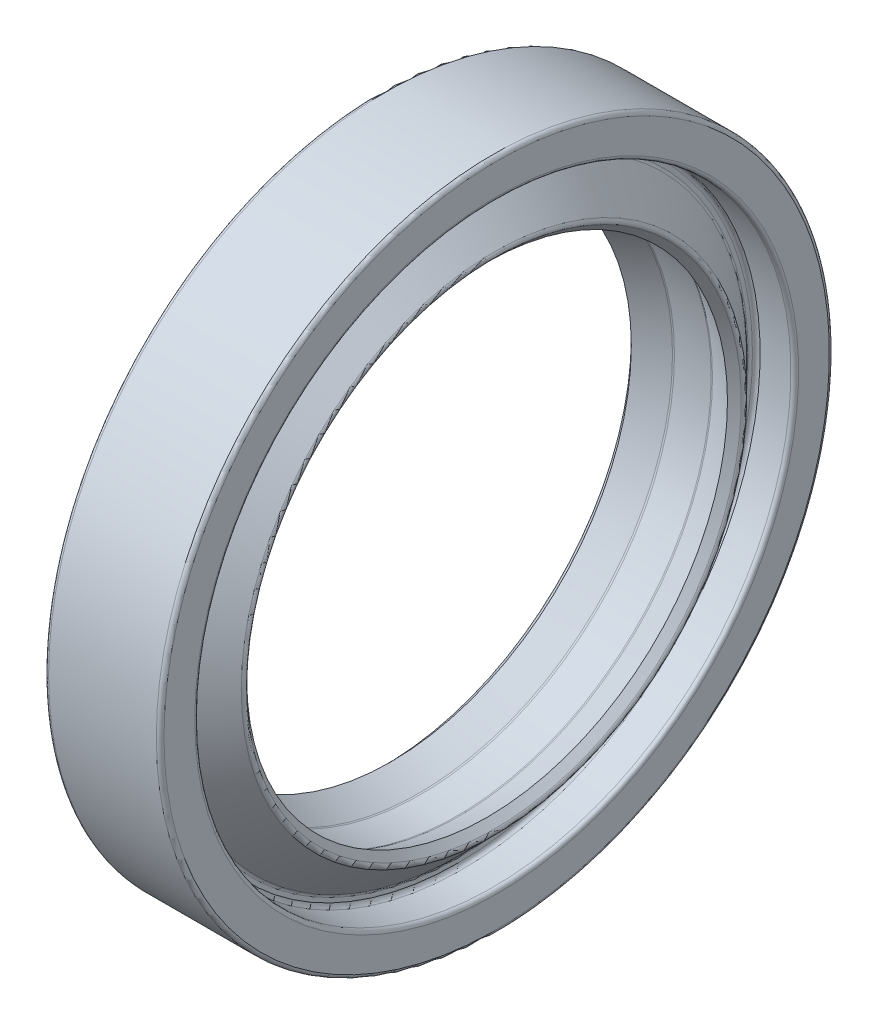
ISO-10303-21;
HEADER;
FILE_DESCRIPTION(('STEP AP214'),'2;1');
FILE_NAME('part.step','',(''),(''),'','','');
FILE_SCHEMA(('AUTOMOTIVE_DESIGN { 1 0 10303 214 1 1 1 1 }'));
ENDSEC;
DATA;
#1=APPLICATION_CONTEXT('core data for automotive mechanical design processes');
#2=APPLICATION_PROTOCOL_DEFINITION('international standard','automotive_design',2000,#1);
#3=PRODUCT_CONTEXT('',#1,'mechanical');
#4=PRODUCT('Part','Part','',(#3));
#5=PRODUCT_RELATED_PRODUCT_CATEGORY('part','',(#4));
#6=PRODUCT_DEFINITION_FORMATION('','',#4);
#7=PRODUCT_DEFINITION_CONTEXT('part definition',#1,'design');
#8=PRODUCT_DEFINITION('design','',#6,#7);
#9=PRODUCT_DEFINITION_SHAPE('','',#8);
#10=(LENGTH_UNIT() NAMED_UNIT(*) SI_UNIT(.MILLI.,.METRE.));
#11=(NAMED_UNIT(*) PLANE_ANGLE_UNIT() SI_UNIT($,.RADIAN.));
#12=(NAMED_UNIT(*) SI_UNIT($,.STERADIAN.) SOLID_ANGLE_UNIT());
#13=UNCERTAINTY_MEASURE_WITH_UNIT(LENGTH_MEASURE(1.E-05),#10,'distance_accuracy_value','');
#14=(GEOMETRIC_REPRESENTATION_CONTEXT(3) GLOBAL_UNCERTAINTY_ASSIGNED_CONTEXT((#13)) GLOBAL_UNIT_ASSIGNED_CONTEXT((#10,
#11,#12)) REPRESENTATION_CONTEXT('',''));
#15=CARTESIAN_POINT('',(0.,0.,0.));
#16=DIRECTION('',(0.,0.,1.));
#17=DIRECTION('',(1.,0.,0.));
#18=AXIS2_PLACEMENT_3D('',#15,#16,#17);
#19=CARTESIAN_POINT('',(0.,0.,0.));
#20=DIRECTION('',(-1.,0.,0.));
#21=DIRECTION('',(0.,0.,1.));
#22=AXIS2_PLACEMENT_3D('',#19,#20,#21);
#23=CONICAL_SURFACE('',#22,13.,0.785398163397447);
#24=CARTESIAN_POINT('',(0.141421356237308,0.,0.));
#25=DIRECTION('',(1.,0.,0.));
#26=DIRECTION('',(0.,0.,-1.));
#27=AXIS2_PLACEMENT_3D('',#24,#25,#26);
#28=CIRCLE('',#27,12.8585786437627);
#29=CARTESIAN_POINT('',(0.141421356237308,0.,-12.8585786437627));
#30=VERTEX_POINT('',#29);
#31=EDGE_CURVE('E44',#30,#30,#28,.F.);
#32=ORIENTED_EDGE('',*,*,#31,.T.);
#33=EDGE_LOOP('',(#32));
#34=FACE_BOUND('',#33,.T.);
#35=CARTESIAN_POINT('',(0.5,0.,0.));
#36=DIRECTION('',(-1.,0.,0.));
#37=DIRECTION('',(0.,0.,1.));
#38=AXIS2_PLACEMENT_3D('',#35,#36,#37);
#39=CIRCLE('',#38,12.5);
#40=CARTESIAN_POINT('',(0.5,0.,12.5));
#41=VERTEX_POINT('',#40);
#42=EDGE_CURVE('E104',#41,#41,#39,.T.);
#43=ORIENTED_EDGE('',*,*,#42,.F.);
#44=EDGE_LOOP('',(#43));
#45=FACE_BOUND('',#44,.T.);
#46=ADVANCED_FACE('F22',(#34,#45),#23,.F.);
#47=CARTESIAN_POINT('',(2.,0.,0.));
#48=DIRECTION('',(1.,0.,0.));
#49=DIRECTION('',(0.,0.,-1.));
#50=AXIS2_PLACEMENT_3D('',#47,#48,#49);
#51=CONICAL_SURFACE('',#50,15.,0.785398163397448);
#52=CARTESIAN_POINT('',(1.94142135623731,0.,0.));
#53=DIRECTION('',(1.,0.,0.));
#54=DIRECTION('',(0.,0.,-1.));
#55=AXIS2_PLACEMENT_3D('',#52,#53,#54);
#56=CIRCLE('',#55,14.9414213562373);
#57=CARTESIAN_POINT('',(1.94142135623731,0.,-14.9414213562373));
#58=VERTEX_POINT('',#57);
#59=EDGE_CURVE('E47',#58,#58,#56,.F.);
#60=ORIENTED_EDGE('',*,*,#59,.T.);
#61=EDGE_LOOP('',(#60));
#62=FACE_BOUND('',#61,.T.);
#63=CARTESIAN_POINT('',(0.141421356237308,0.,0.));
#64=DIRECTION('',(-1.,0.,0.));
#65=DIRECTION('',(0.,0.,1.));
#66=AXIS2_PLACEMENT_3D('',#63,#64,#65);
#67=CIRCLE('',#66,13.1414213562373);
#68=CARTESIAN_POINT('',(0.141421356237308,0.,13.1414213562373));
#69=VERTEX_POINT('',#68);
#70=EDGE_CURVE('E50',#69,#69,#67,.F.);
#71=ORIENTED_EDGE('',*,*,#70,.T.);
#72=EDGE_LOOP('',(#71));
#73=FACE_BOUND('',#72,.T.);
#74=ADVANCED_FACE('F111',(#62,#73),#51,.T.);
#75=CARTESIAN_POINT('',(2.,15.5,0.));
#76=DIRECTION('',(1.,0.,0.));
#77=DIRECTION('',(0.,0.,-1.));
#78=AXIS2_PLACEMENT_3D('',#75,#76,#77);
#79=PLANE('',#78);
#80=CARTESIAN_POINT('',(2.,0.,0.));
#81=DIRECTION('',(1.,0.,0.));
#82=DIRECTION('',(0.,0.,-1.));
#83=AXIS2_PLACEMENT_3D('',#80,#81,#82);
#84=CIRCLE('',#83,15.3);
#85=CARTESIAN_POINT('',(2.,0.,-15.3));
#86=VERTEX_POINT('',#85);
#87=EDGE_CURVE('E53',#86,#86,#84,.F.);
#88=ORIENTED_EDGE('',*,*,#87,.T.);
#89=EDGE_LOOP('',(#88));
#90=FACE_BOUND('',#89,.T.);
#91=CARTESIAN_POINT('',(2.,0.,0.));
#92=DIRECTION('',(1.,0.,0.));
#93=DIRECTION('',(0.,0.,-1.));
#94=AXIS2_PLACEMENT_3D('',#91,#92,#93);
#95=CIRCLE('',#94,15.0828427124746);
#96=CARTESIAN_POINT('',(2.,0.,-15.0828427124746));
#97=VERTEX_POINT('',#96);
#98=EDGE_CURVE('E56',#97,#97,#95,.T.);
#99=ORIENTED_EDGE('',*,*,#98,.T.);
#100=EDGE_LOOP('',(#99));
#101=FACE_BOUND('',#100,.T.);
#102=ADVANCED_FACE('F116',(#90,#101),#79,.F.);
#103=CARTESIAN_POINT('',(-58.0974245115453,0.,0.));
#104=DIRECTION('',(-1.,0.,0.));
#105=DIRECTION('',(0.,0.,1.));
#106=AXIS2_PLACEMENT_3D('',#103,#104,#105);
#107=CYLINDRICAL_SURFACE('',#106,15.5);
#108=CARTESIAN_POINT('',(0.199999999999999,0.,0.));
#109=DIRECTION('',(1.,0.,0.));
#110=DIRECTION('',(0.,0.,-1.));
#111=AXIS2_PLACEMENT_3D('',#108,#109,#110);
#112=CIRCLE('',#111,15.5);
#113=CARTESIAN_POINT('',(0.199999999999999,0.,-15.5));
#114=VERTEX_POINT('',#113);
#115=EDGE_CURVE('E65',#114,#114,#112,.F.);
#116=ORIENTED_EDGE('',*,*,#115,.T.);
#117=EDGE_LOOP('',(#116));
#118=FACE_BOUND('',#117,.T.);
#119=CARTESIAN_POINT('',(1.8,0.,0.));
#120=DIRECTION('',(1.,0.,0.));
#121=DIRECTION('',(0.,0.,-1.));
#122=AXIS2_PLACEMENT_3D('',#119,#120,#121);
#123=CIRCLE('',#122,15.5);
#124=CARTESIAN_POINT('',(1.8,0.,-15.5));
#125=VERTEX_POINT('',#124);
#126=EDGE_CURVE('E68',#125,#125,#123,.T.);
#127=ORIENTED_EDGE('',*,*,#126,.T.);
#128=EDGE_LOOP('',(#127));
#129=FACE_BOUND('',#128,.T.);
#130=ADVANCED_FACE('F199',(#118,#129),#107,.F.);
#131=CARTESIAN_POINT('',(0.,17.5,0.));
#132=DIRECTION('',(1.,0.,0.));
#133=DIRECTION('',(0.,0.,-1.));
#134=AXIS2_PLACEMENT_3D('',#131,#132,#133);
#135=PLANE('',#134);
#136=CARTESIAN_POINT('',(0.,0.,0.));
#137=DIRECTION('',(1.,0.,0.));
#138=DIRECTION('',(0.,0.,-1.));
#139=AXIS2_PLACEMENT_3D('',#136,#137,#138);
#140=CIRCLE('',#139,15.7);
#141=CARTESIAN_POINT('',(0.,0.,-15.7));
#142=VERTEX_POINT('',#141);
#143=EDGE_CURVE('E59',#142,#142,#140,.T.);
#144=ORIENTED_EDGE('',*,*,#143,.T.);
#145=EDGE_LOOP('',(#144));
#146=FACE_BOUND('',#145,.T.);
#147=CARTESIAN_POINT('',(0.,0.,0.));
#148=DIRECTION('',(1.,0.,0.));
#149=DIRECTION('',(0.,0.,-1.));
#150=AXIS2_PLACEMENT_3D('',#147,#148,#149);
#151=CIRCLE('',#150,17.3);
#152=CARTESIAN_POINT('',(0.,0.,-17.3));
#153=VERTEX_POINT('',#152);
#154=EDGE_CURVE('E62',#153,#153,#151,.F.);
#155=ORIENTED_EDGE('',*,*,#154,.T.);
#156=EDGE_LOOP('',(#155));
#157=FACE_BOUND('',#156,.T.);
#158=ADVANCED_FACE('F196',(#146,#157),#135,.F.);
#159=CARTESIAN_POINT('',(-58.0974245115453,0.,0.));
#160=DIRECTION('',(-1.,0.,0.));
#161=DIRECTION('',(0.,0.,1.));
#162=AXIS2_PLACEMENT_3D('',#159,#160,#161);
#163=CYLINDRICAL_SURFACE('',#162,17.5);
#164=CARTESIAN_POINT('',(5.8,0.,0.));
#165=DIRECTION('',(-1.,0.,0.));
#166=DIRECTION('',(0.,0.,1.));
#167=AXIS2_PLACEMENT_3D('',#164,#165,#166);
#168=CIRCLE('',#167,17.5);
#169=CARTESIAN_POINT('',(5.8,0.,17.5));
#170=VERTEX_POINT('',#169);
#171=EDGE_CURVE('E10',#170,#170,#168,.T.);
#172=ORIENTED_EDGE('',*,*,#171,.T.);
#173=EDGE_LOOP('',(#172));
#174=FACE_BOUND('',#173,.T.);
#175=CARTESIAN_POINT('',(0.199999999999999,0.,0.));
#176=DIRECTION('',(1.,0.,0.));
#177=DIRECTION('',(0.,0.,-1.));
#178=AXIS2_PLACEMENT_3D('',#175,#176,#177);
#179=CIRCLE('',#178,17.5);
#180=CARTESIAN_POINT('',(0.199999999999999,0.,-17.5));
#181=VERTEX_POINT('',#180);
#182=EDGE_CURVE('E28',#181,#181,#179,.T.);
#183=ORIENTED_EDGE('',*,*,#182,.T.);
#184=EDGE_LOOP('',(#183));
#185=FACE_BOUND('',#184,.T.);
#186=ADVANCED_FACE('F192',(#174,#185),#163,.T.);
#187=CARTESIAN_POINT('',(6.,15.5,0.));
#188=DIRECTION('',(-1.,0.,0.));
#189=DIRECTION('',(0.,0.,1.));
#190=AXIS2_PLACEMENT_3D('',#187,#188,#189);
#191=PLANE('',#190);
#192=CARTESIAN_POINT('',(6.,0.,0.));
#193=DIRECTION('',(-1.,0.,0.));
#194=DIRECTION('',(0.,0.,1.));
#195=AXIS2_PLACEMENT_3D('',#192,#193,#194);
#196=CIRCLE('',#195,15.7);
#197=CARTESIAN_POINT('',(6.,0.,15.7));
#198=VERTEX_POINT('',#197);
#199=EDGE_CURVE('E71',#198,#198,#196,.T.);
#200=ORIENTED_EDGE('',*,*,#199,.T.);
#201=EDGE_LOOP('',(#200));
#202=FACE_BOUND('',#201,.T.);
#203=CARTESIAN_POINT('',(6.,0.,0.));
#204=DIRECTION('',(-1.,0.,0.));
#205=DIRECTION('',(0.,0.,1.));
#206=AXIS2_PLACEMENT_3D('',#203,#204,#205);
#207=CIRCLE('',#206,17.3);
#208=CARTESIAN_POINT('',(6.,0.,17.3));
#209=VERTEX_POINT('',#208);
#210=EDGE_CURVE('E74',#209,#209,#207,.F.);
#211=ORIENTED_EDGE('',*,*,#210,.T.);
#212=EDGE_LOOP('',(#211));
#213=FACE_BOUND('',#212,.T.);
#214=ADVANCED_FACE('F188',(#202,#213),#191,.F.);
#215=CARTESIAN_POINT('',(-58.0974245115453,0.,0.));
#216=DIRECTION('',(-1.,0.,0.));
#217=DIRECTION('',(0.,0.,1.));
#218=AXIS2_PLACEMENT_3D('',#215,#216,#217);
#219=CYLINDRICAL_SURFACE('',#218,15.5);
#220=CARTESIAN_POINT('',(4.2,0.,0.));
#221=DIRECTION('',(-1.,0.,0.));
#222=DIRECTION('',(0.,0.,1.));
#223=AXIS2_PLACEMENT_3D('',#220,#221,#222);
#224=CIRCLE('',#223,15.5);
#225=CARTESIAN_POINT('',(4.2,0.,15.5));
#226=VERTEX_POINT('',#225);
#227=EDGE_CURVE('E83',#226,#226,#224,.T.);
#228=ORIENTED_EDGE('',*,*,#227,.T.);
#229=EDGE_LOOP('',(#228));
#230=FACE_BOUND('',#229,.T.);
#231=CARTESIAN_POINT('',(5.8,0.,0.));
#232=DIRECTION('',(-1.,0.,0.));
#233=DIRECTION('',(0.,0.,1.));
#234=AXIS2_PLACEMENT_3D('',#231,#232,#233);
#235=CIRCLE('',#234,15.5);
#236=CARTESIAN_POINT('',(5.8,0.,15.5));
#237=VERTEX_POINT('',#236);
#238=EDGE_CURVE('E86',#237,#237,#235,.F.);
#239=ORIENTED_EDGE('',*,*,#238,.T.);
#240=EDGE_LOOP('',(#239));
#241=FACE_BOUND('',#240,.T.);
#242=ADVANCED_FACE('F184',(#230,#241),#219,.F.);
#243=CARTESIAN_POINT('',(4.,15.,0.));
#244=DIRECTION('',(-1.,0.,0.));
#245=DIRECTION('',(0.,0.,1.));
#246=AXIS2_PLACEMENT_3D('',#243,#244,#245);
#247=PLANE('',#246);
#248=CARTESIAN_POINT('',(4.,0.,0.));
#249=DIRECTION('',(-1.,0.,0.));
#250=DIRECTION('',(0.,0.,1.));
#251=AXIS2_PLACEMENT_3D('',#248,#249,#250);
#252=CIRCLE('',#251,15.3);
#253=CARTESIAN_POINT('',(4.,0.,15.3));
#254=VERTEX_POINT('',#253);
#255=EDGE_CURVE('E77',#254,#254,#252,.F.);
#256=ORIENTED_EDGE('',*,*,#255,.T.);
#257=EDGE_LOOP('',(#256));
#258=FACE_BOUND('',#257,.T.);
#259=CARTESIAN_POINT('',(4.,0.,0.));
#260=DIRECTION('',(-1.,0.,0.));
#261=DIRECTION('',(0.,0.,1.));
#262=AXIS2_PLACEMENT_3D('',#259,#260,#261);
#263=CIRCLE('',#262,15.0828427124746);
#264=CARTESIAN_POINT('',(4.,0.,15.0828427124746));
#265=VERTEX_POINT('',#264);
#266=EDGE_CURVE('E80',#265,#265,#263,.T.);
#267=ORIENTED_EDGE('',*,*,#266,.T.);
#268=EDGE_LOOP('',(#267));
#269=FACE_BOUND('',#268,.T.);
#270=ADVANCED_FACE('F180',(#258,#269),#247,.F.);
#271=CARTESIAN_POINT('',(6.00000000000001,0.,0.));
#272=DIRECTION('',(-1.,0.,0.));
#273=DIRECTION('',(0.,0.,1.));
#274=AXIS2_PLACEMENT_3D('',#271,#272,#273);
#275=CONICAL_SURFACE('',#274,13.,0.785398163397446);
#276=CARTESIAN_POINT('',(5.85857864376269,0.,0.));
#277=DIRECTION('',(1.,0.,0.));
#278=DIRECTION('',(0.,0.,-1.));
#279=AXIS2_PLACEMENT_3D('',#276,#277,#278);
#280=CIRCLE('',#279,13.1414213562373);
#281=CARTESIAN_POINT('',(5.85857864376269,0.,-13.1414213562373));
#282=VERTEX_POINT('',#281);
#283=EDGE_CURVE('E36',#282,#282,#280,.F.);
#284=ORIENTED_EDGE('',*,*,#283,.T.);
#285=EDGE_LOOP('',(#284));
#286=FACE_BOUND('',#285,.T.);
#287=CARTESIAN_POINT('',(4.05857864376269,0.,0.));
#288=DIRECTION('',(-1.,0.,0.));
#289=DIRECTION('',(0.,0.,1.));
#290=AXIS2_PLACEMENT_3D('',#287,#288,#289);
#291=CIRCLE('',#290,14.9414213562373);
#292=CARTESIAN_POINT('',(4.05857864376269,0.,14.9414213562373));
#293=VERTEX_POINT('',#292);
#294=EDGE_CURVE('E41',#293,#293,#291,.F.);
#295=ORIENTED_EDGE('',*,*,#294,.T.);
#296=EDGE_LOOP('',(#295));
#297=FACE_BOUND('',#296,.T.);
#298=ADVANCED_FACE('F176',(#286,#297),#275,.T.);
#299=CARTESIAN_POINT('',(5.50000000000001,0.,0.));
#300=DIRECTION('',(1.,0.,0.));
#301=DIRECTION('',(0.,0.,-1.));
#302=AXIS2_PLACEMENT_3D('',#299,#300,#301);
#303=CONICAL_SURFACE('',#302,12.5,0.785398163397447);
#304=CARTESIAN_POINT('',(5.8585786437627,0.,0.));
#305=DIRECTION('',(-1.,0.,0.));
#306=DIRECTION('',(0.,0.,1.));
#307=AXIS2_PLACEMENT_3D('',#304,#305,#306);
#308=CIRCLE('',#307,12.8585786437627);
#309=CARTESIAN_POINT('',(5.8585786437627,0.,12.8585786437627));
#310=VERTEX_POINT('',#309);
#311=EDGE_CURVE('E32',#310,#310,#308,.F.);
#312=ORIENTED_EDGE('',*,*,#311,.T.);
#313=EDGE_LOOP('',(#312));
#314=FACE_BOUND('',#313,.T.);
#315=CARTESIAN_POINT('',(5.50000000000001,0.,0.));
#316=DIRECTION('',(-1.,0.,0.));
#317=DIRECTION('',(0.,0.,1.));
#318=AXIS2_PLACEMENT_3D('',#315,#316,#317);
#319=CIRCLE('',#318,12.5);
#320=CARTESIAN_POINT('',(5.50000000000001,0.,12.5));
#321=VERTEX_POINT('',#320);
#322=EDGE_CURVE('E101',#321,#321,#319,.T.);
#323=ORIENTED_EDGE('',*,*,#322,.T.);
#324=EDGE_LOOP('',(#323));
#325=FACE_BOUND('',#324,.T.);
#326=ADVANCED_FACE('F172',(#314,#325),#303,.F.);
#327=CARTESIAN_POINT('',(4.,0.,0.));
#328=DIRECTION('',(-1.,0.,0.));
#329=DIRECTION('',(0.,0.,1.));
#330=AXIS2_PLACEMENT_3D('',#327,#328,#329);
#331=CONICAL_SURFACE('',#330,13.2,0.436627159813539);
#332=CARTESIAN_POINT('',(4.04020722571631,0.,0.));
#333=DIRECTION('',(-1.,0.,0.));
#334=DIRECTION('',(0.,0.,1.));
#335=AXIS2_PLACEMENT_3D('',#332,#333,#334);
#336=CIRCLE('',#335,13.1812366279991);
#337=CARTESIAN_POINT('',(4.04020722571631,0.,13.1812366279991));
#338=VERTEX_POINT('',#337);
#339=EDGE_CURVE('E89',#338,#338,#336,.T.);
#340=ORIENTED_EDGE('',*,*,#339,.T.);
#341=EDGE_LOOP('',(#340));
#342=FACE_BOUND('',#341,.T.);
#343=ORIENTED_EDGE('',*,*,#322,.F.);
#344=EDGE_LOOP('',(#343));
#345=FACE_BOUND('',#344,.T.);
#346=ADVANCED_FACE('F168',(#342,#345),#331,.F.);
#347=CARTESIAN_POINT('',(-58.0974245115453,0.,0.));
#348=DIRECTION('',(-1.,0.,0.));
#349=DIRECTION('',(0.,0.,1.));
#350=AXIS2_PLACEMENT_3D('',#347,#348,#349);
#351=CYLINDRICAL_SURFACE('',#350,13.2);
#352=CARTESIAN_POINT('',(2.04436986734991,0.,0.));
#353=DIRECTION('',(-1.,0.,0.));
#354=DIRECTION('',(0.,0.,1.));
#355=AXIS2_PLACEMENT_3D('',#352,#353,#354);
#356=CIRCLE('',#355,13.2);
#357=CARTESIAN_POINT('',(2.04436986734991,0.,13.2));
#358=VERTEX_POINT('',#357);
#359=EDGE_CURVE('E95',#358,#358,#356,.T.);
#360=ORIENTED_EDGE('',*,*,#359,.T.);
#361=EDGE_LOOP('',(#360));
#362=FACE_BOUND('',#361,.T.);
#363=CARTESIAN_POINT('',(3.95563013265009,0.,0.));
#364=DIRECTION('',(-1.,0.,0.));
#365=DIRECTION('',(0.,0.,1.));
#366=AXIS2_PLACEMENT_3D('',#363,#364,#365);
#367=CIRCLE('',#366,13.2);
#368=CARTESIAN_POINT('',(3.95563013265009,0.,13.2));
#369=VERTEX_POINT('',#368);
#370=EDGE_CURVE('E98',#369,#369,#367,.F.);
#371=ORIENTED_EDGE('',*,*,#370,.T.);
#372=EDGE_LOOP('',(#371));
#373=FACE_BOUND('',#372,.T.);
#374=ADVANCED_FACE('F164',(#362,#373),#351,.F.);
#375=CARTESIAN_POINT('',(0.5,0.,0.));
#376=DIRECTION('',(1.,0.,0.));
#377=DIRECTION('',(0.,0.,-1.));
#378=AXIS2_PLACEMENT_3D('',#375,#376,#377);
#379=CONICAL_SURFACE('',#378,12.5,0.43662715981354);
#380=CARTESIAN_POINT('',(1.95979277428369,0.,0.));
#381=DIRECTION('',(1.,0.,0.));
#382=DIRECTION('',(0.,0.,-1.));
#383=AXIS2_PLACEMENT_3D('',#380,#381,#382);
#384=CIRCLE('',#383,13.1812366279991);
#385=CARTESIAN_POINT('',(1.95979277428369,0.,-13.1812366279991));
#386=VERTEX_POINT('',#385);
#387=EDGE_CURVE('E92',#386,#386,#384,.T.);
#388=ORIENTED_EDGE('',*,*,#387,.T.);
#389=EDGE_LOOP('',(#388));
#390=FACE_BOUND('',#389,.T.);
#391=ORIENTED_EDGE('',*,*,#42,.T.);
#392=EDGE_LOOP('',(#391));
#393=FACE_BOUND('',#392,.T.);
#394=ADVANCED_FACE('F108',(#390,#393),#379,.F.);
#395=CARTESIAN_POINT('',(2.04436986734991,0.,0.));
#396=DIRECTION('',(-1.,0.,0.));
#397=DIRECTION('',(0.,0.,1.));
#398=AXIS2_PLACEMENT_3D('',#395,#396,#397);
#399=TOROIDAL_SURFACE('',#398,13.,0.2);
#400=ORIENTED_EDGE('',*,*,#387,.F.);
#401=EDGE_LOOP('',(#400));
#402=FACE_BOUND('',#401,.T.);
#403=ORIENTED_EDGE('',*,*,#359,.F.);
#404=EDGE_LOOP('',(#403));
#405=FACE_BOUND('',#404,.T.);
#406=ADVANCED_FACE('F157',(#402,#405),#399,.F.);
#407=CARTESIAN_POINT('',(3.95563013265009,0.,0.));
#408=DIRECTION('',(-1.,0.,0.));
#409=DIRECTION('',(0.,0.,1.));
#410=AXIS2_PLACEMENT_3D('',#407,#408,#409);
#411=TOROIDAL_SURFACE('',#410,13.,0.2);
#412=ORIENTED_EDGE('',*,*,#370,.F.);
#413=EDGE_LOOP('',(#412));
#414=FACE_BOUND('',#413,.T.);
#415=ORIENTED_EDGE('',*,*,#339,.F.);
#416=EDGE_LOOP('',(#415));
#417=FACE_BOUND('',#416,.T.);
#418=ADVANCED_FACE('F153',(#414,#417),#411,.F.);
#419=CARTESIAN_POINT('',(4.2,0.,0.));
#420=DIRECTION('',(-1.,0.,0.));
#421=DIRECTION('',(0.,0.,1.));
#422=AXIS2_PLACEMENT_3D('',#419,#420,#421);
#423=TOROIDAL_SURFACE('',#422,15.3,0.2);
#424=ORIENTED_EDGE('',*,*,#255,.F.);
#425=EDGE_LOOP('',(#424));
#426=FACE_BOUND('',#425,.T.);
#427=ORIENTED_EDGE('',*,*,#227,.F.);
#428=EDGE_LOOP('',(#427));
#429=FACE_BOUND('',#428,.T.);
#430=ADVANCED_FACE('F149',(#426,#429),#423,.F.);
#431=CARTESIAN_POINT('',(5.8,0.,0.));
#432=DIRECTION('',(-1.,0.,0.));
#433=DIRECTION('',(0.,0.,1.));
#434=AXIS2_PLACEMENT_3D('',#431,#432,#433);
#435=TOROIDAL_SURFACE('',#434,15.7,0.2);
#436=ORIENTED_EDGE('',*,*,#238,.F.);
#437=EDGE_LOOP('',(#436));
#438=FACE_BOUND('',#437,.T.);
#439=ORIENTED_EDGE('',*,*,#199,.F.);
#440=EDGE_LOOP('',(#439));
#441=FACE_BOUND('',#440,.T.);
#442=ADVANCED_FACE('F145',(#438,#441),#435,.T.);
#443=CARTESIAN_POINT('',(0.199999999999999,0.,0.));
#444=DIRECTION('',(1.,0.,0.));
#445=DIRECTION('',(0.,0.,-1.));
#446=AXIS2_PLACEMENT_3D('',#443,#444,#445);
#447=TOROIDAL_SURFACE('',#446,15.7,0.2);
#448=ORIENTED_EDGE('',*,*,#143,.F.);
#449=EDGE_LOOP('',(#448));
#450=FACE_BOUND('',#449,.T.);
#451=ORIENTED_EDGE('',*,*,#115,.F.);
#452=EDGE_LOOP('',(#451));
#453=FACE_BOUND('',#452,.T.);
#454=ADVANCED_FACE('F141',(#450,#453),#447,.T.);
#455=CARTESIAN_POINT('',(1.8,0.,0.));
#456=DIRECTION('',(1.,0.,0.));
#457=DIRECTION('',(0.,0.,-1.));
#458=AXIS2_PLACEMENT_3D('',#455,#456,#457);
#459=TOROIDAL_SURFACE('',#458,15.3,0.2);
#460=ORIENTED_EDGE('',*,*,#126,.F.);
#461=EDGE_LOOP('',(#460));
#462=FACE_BOUND('',#461,.T.);
#463=ORIENTED_EDGE('',*,*,#87,.F.);
#464=EDGE_LOOP('',(#463));
#465=FACE_BOUND('',#464,.T.);
#466=ADVANCED_FACE('F133',(#462,#465),#459,.F.);
#467=CARTESIAN_POINT('',(1.8,0.,0.));
#468=DIRECTION('',(1.,0.,0.));
#469=DIRECTION('',(0.,0.,-1.));
#470=AXIS2_PLACEMENT_3D('',#467,#468,#469);
#471=TOROIDAL_SURFACE('',#470,15.0828427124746,0.2);
#472=ORIENTED_EDGE('',*,*,#98,.F.);
#473=EDGE_LOOP('',(#472));
#474=FACE_BOUND('',#473,.T.);
#475=ORIENTED_EDGE('',*,*,#59,.F.);
#476=EDGE_LOOP('',(#475));
#477=FACE_BOUND('',#476,.T.);
#478=ADVANCED_FACE('F123',(#474,#477),#471,.F.);
#479=CARTESIAN_POINT('',(0.282842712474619,0.,0.));
#480=DIRECTION('',(1.,0.,0.));
#481=DIRECTION('',(0.,0.,-1.));
#482=AXIS2_PLACEMENT_3D('',#479,#480,#481);
#483=TOROIDAL_SURFACE('',#482,13.,0.2);
#484=ORIENTED_EDGE('',*,*,#70,.F.);
#485=EDGE_LOOP('',(#484));
#486=FACE_BOUND('',#485,.T.);
#487=ORIENTED_EDGE('',*,*,#31,.F.);
#488=EDGE_LOOP('',(#487));
#489=FACE_BOUND('',#488,.T.);
#490=ADVANCED_FACE('F120',(#486,#489),#483,.T.);
#491=CARTESIAN_POINT('',(5.71715728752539,0.,0.));
#492=DIRECTION('',(1.,0.,0.));
#493=DIRECTION('',(0.,0.,-1.));
#494=AXIS2_PLACEMENT_3D('',#491,#492,#493);
#495=TOROIDAL_SURFACE('',#494,13.,0.2);
#496=ORIENTED_EDGE('',*,*,#311,.F.);
#497=EDGE_LOOP('',(#496));
#498=FACE_BOUND('',#497,.T.);
#499=ORIENTED_EDGE('',*,*,#283,.F.);
#500=EDGE_LOOP('',(#499));
#501=FACE_BOUND('',#500,.T.);
#502=ADVANCED_FACE('F122',(#498,#501),#495,.T.);
#503=CARTESIAN_POINT('',(4.2,0.,0.));
#504=DIRECTION('',(-1.,0.,0.));
#505=DIRECTION('',(0.,0.,1.));
#506=AXIS2_PLACEMENT_3D('',#503,#504,#505);
#507=TOROIDAL_SURFACE('',#506,15.0828427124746,0.2);
#508=ORIENTED_EDGE('',*,*,#294,.F.);
#509=EDGE_LOOP('',(#508));
#510=FACE_BOUND('',#509,.T.);
#511=ORIENTED_EDGE('',*,*,#266,.F.);
#512=EDGE_LOOP('',(#511));
#513=FACE_BOUND('',#512,.T.);
#514=ADVANCED_FACE('F130',(#510,#513),#507,.F.);
#515=CARTESIAN_POINT('',(5.8,0.,0.));
#516=DIRECTION('',(-1.,0.,0.));
#517=DIRECTION('',(0.,0.,1.));
#518=AXIS2_PLACEMENT_3D('',#515,#516,#517);
#519=TOROIDAL_SURFACE('',#518,17.3,0.2);
#520=ORIENTED_EDGE('',*,*,#210,.F.);
#521=EDGE_LOOP('',(#520));
#522=FACE_BOUND('',#521,.T.);
#523=ORIENTED_EDGE('',*,*,#171,.F.);
#524=EDGE_LOOP('',(#523));
#525=FACE_BOUND('',#524,.T.);
#526=ADVANCED_FACE('F302',(#522,#525),#519,.T.);
#527=CARTESIAN_POINT('',(0.199999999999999,0.,0.));
#528=DIRECTION('',(1.,0.,0.));
#529=DIRECTION('',(0.,0.,-1.));
#530=AXIS2_PLACEMENT_3D('',#527,#528,#529);
#531=TOROIDAL_SURFACE('',#530,17.3,0.2);
#532=ORIENTED_EDGE('',*,*,#182,.F.);
#533=EDGE_LOOP('',(#532));
#534=FACE_BOUND('',#533,.T.);
#535=ORIENTED_EDGE('',*,*,#154,.F.);
#536=EDGE_LOOP('',(#535));
#537=FACE_BOUND('',#536,.T.);
#538=ADVANCED_FACE('F309',(#534,#537),#531,.T.);
#539=CLOSED_SHELL('',(#46,#74,#102,#130,#158,#186,#214,#242,#270,#298,#326,#346,#374,#394,#406,
#418,#430,#442,#454,#466,#478,#490,#502,#514,#526,#538));
#540=MANIFOLD_SOLID_BREP('B2',#539);
#541=ADVANCED_BREP_SHAPE_REPRESENTATION('',(#18,#540),#14);
#542=SHAPE_DEFINITION_REPRESENTATION(#9,#541);
ENDSEC;
END-ISO-10303-21;
